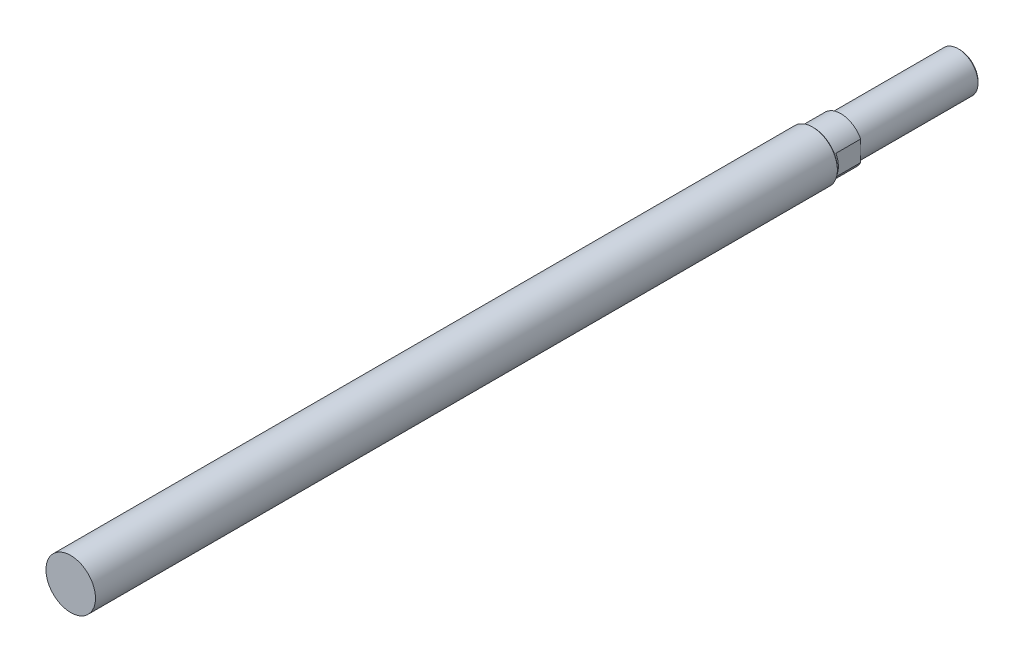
from build123d import *

# Parameters (mm, degrees)
ESQUISSE1_R             = 5
BASE_EXTRUSION_DEPTH    = 150
ESQUISSE2_R             = 4.5
BOSS_EXTRU_1_DEPTH      = 5.5
ENL_V_START             = -5
ENL_V_MAT_EXTRU_1_DEPTH = 5
CHANFREIN1_SIZE         = 0.2
ESQUISSE4_R             = 4
BOSS_EXTRU_2_DEPTH      = 24
CHANFREIN2_SIZE         = 0.3


with BuildPart() as part:
    # Esquisse1 → Base-Extrusion (new body)
    with BuildSketch(Plane.XY):
        Circle(ESQUISSE1_R)
    extrude(amount=BASE_EXTRUSION_DEPTH)

    # Esquisse2 → Boss.-Extru.1 (add)
    with BuildSketch(Plane(origin=(0, 0, 0), x_dir=(-1, 0, 0), z_dir=(0, 0, -1))):
        with Locations(Location((0, 0, 0), (0, 0, 180))):
            Circle(ESQUISSE2_R)
    extrude(amount=BOSS_EXTRU_1_DEPTH)

    # Esquisse3 → Enl_v. mat.-Extru.1 (cut)
    with BuildSketch(Plane(origin=(0, 0, -5.5), x_dir=(-1, 0, 0), z_dir=(0, 0, -1)).offset(ENL_V_START)):
        with BuildLine():
            Line((4, 2.061552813), (4, -2.061552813))
            ThreePointArc((4, -2.061552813), (4.5, 0), (4, 2.061552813))
        make_face()
        with BuildLine():
            Line((-4, 2.061552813), (-4, -2.061552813))
            ThreePointArc((-4, -2.061552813), (-4.5, 0), (-4, 2.061552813))
        make_face()
    extrude(amount=ENL_V_MAT_EXTRU_1_DEPTH, mode=Mode.SUBTRACT)

    # Chanfrein1
    chanfrein1_edges = [part.edges().sort_by_distance(p)[0] for p in [
        (-5, 0, 0),
    ]]
    chamfer(chanfrein1_edges, length=CHANFREIN1_SIZE)

    # Esquisse4 → Boss.-Extru.2 (add)
    with BuildSketch(Plane(origin=(0, 0, -5.5), x_dir=(-1, 0, 0), z_dir=(0, 0, -1))):
        Circle(ESQUISSE4_R)
    extrude(amount=BOSS_EXTRU_2_DEPTH)

    # Chanfrein2
    chanfrein2_edges = [part.edges().sort_by_distance(p)[0] for p in [
        (4, 0, -29.5),
    ]]
    chamfer(chanfrein2_edges, length=CHANFREIN2_SIZE)


solid = part.part
